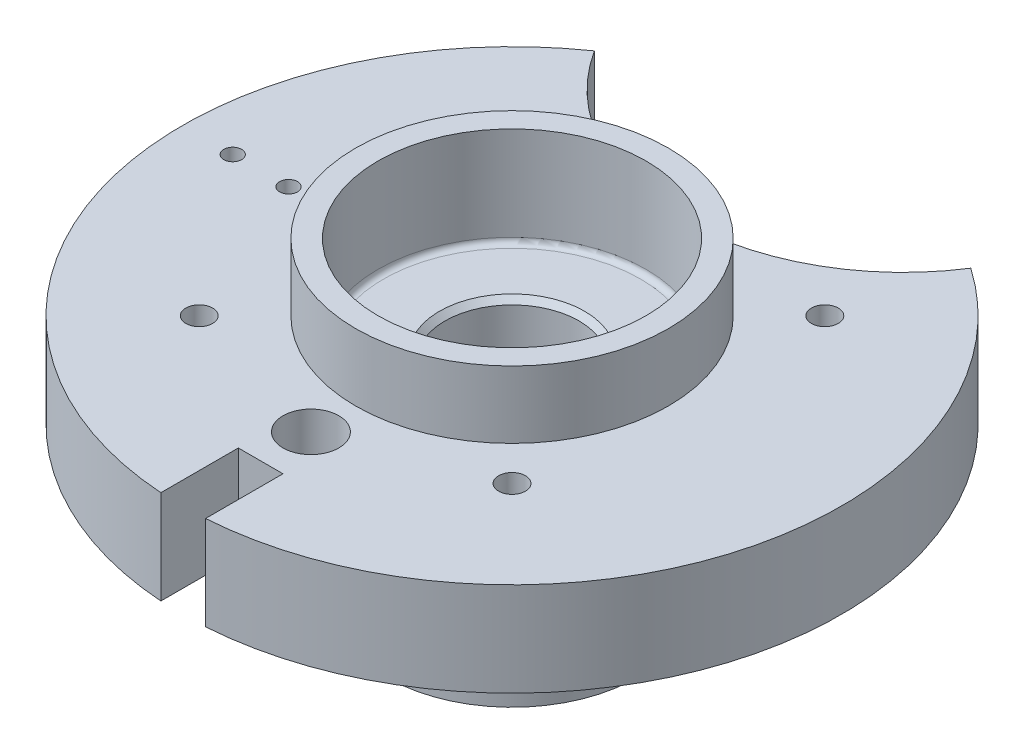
ISO-10303-21;
HEADER;
FILE_DESCRIPTION(('STEP AP214'),'2;1');
FILE_NAME('part.step','',(''),(''),'','','');
FILE_SCHEMA(('AUTOMOTIVE_DESIGN { 1 0 10303 214 1 1 1 1 }'));
ENDSEC;
DATA;
#1=APPLICATION_CONTEXT('core data for automotive mechanical design processes');
#2=APPLICATION_PROTOCOL_DEFINITION('international standard','automotive_design',2000,#1);
#3=PRODUCT_CONTEXT('',#1,'mechanical');
#4=PRODUCT('Part','Part','',(#3));
#5=PRODUCT_RELATED_PRODUCT_CATEGORY('part','',(#4));
#6=PRODUCT_DEFINITION_FORMATION('','',#4);
#7=PRODUCT_DEFINITION_CONTEXT('part definition',#1,'design');
#8=PRODUCT_DEFINITION('design','',#6,#7);
#9=PRODUCT_DEFINITION_SHAPE('','',#8);
#10=(LENGTH_UNIT() NAMED_UNIT(*) SI_UNIT(.MILLI.,.METRE.));
#11=(NAMED_UNIT(*) PLANE_ANGLE_UNIT() SI_UNIT($,.RADIAN.));
#12=(NAMED_UNIT(*) SI_UNIT($,.STERADIAN.) SOLID_ANGLE_UNIT());
#13=UNCERTAINTY_MEASURE_WITH_UNIT(LENGTH_MEASURE(1.E-05),#10,'distance_accuracy_value','');
#14=(GEOMETRIC_REPRESENTATION_CONTEXT(3) GLOBAL_UNCERTAINTY_ASSIGNED_CONTEXT((#13)) GLOBAL_UNIT_ASSIGNED_CONTEXT((#10,
#11,#12)) REPRESENTATION_CONTEXT('',''));
#15=CARTESIAN_POINT('',(0.,0.,0.));
#16=DIRECTION('',(0.,0.,1.));
#17=DIRECTION('',(1.,0.,0.));
#18=AXIS2_PLACEMENT_3D('',#15,#16,#17);
#19=CARTESIAN_POINT('',(0.,0.,0.));
#20=DIRECTION('',(0.,-1.,0.));
#21=DIRECTION('',(0.,0.,-1.));
#22=AXIS2_PLACEMENT_3D('',#19,#20,#21);
#23=CYLINDRICAL_SURFACE('',#22,59.);
#24=CARTESIAN_POINT('',(0.,28.,0.));
#25=DIRECTION('',(0.,-1.,0.));
#26=DIRECTION('',(0.,0.,-1.));
#27=AXIS2_PLACEMENT_3D('',#24,#25,#26);
#28=CIRCLE('',#27,59.);
#29=CARTESIAN_POINT('',(-4.,28.,58.8642506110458));
#30=VERTEX_POINT('',#29);
#31=CARTESIAN_POINT('',(-33.6894877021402,28.,-48.4357142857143));
#32=VERTEX_POINT('',#31);
#33=EDGE_CURVE('E118',#30,#32,#28,.T.);
#34=ORIENTED_EDGE('',*,*,#33,.F.);
#35=DIRECTION('',(0.,1.,0.));
#36=VECTOR('',#35,1.);
#37=CARTESIAN_POINT('',(-4.,-0.001000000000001,58.8642506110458));
#38=LINE('',#37,#36);
#39=CARTESIAN_POINT('',(-4.,44.8,58.8642506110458));
#40=VERTEX_POINT('',#39);
#41=EDGE_CURVE('E100',#30,#40,#38,.T.);
#42=ORIENTED_EDGE('',*,*,#41,.T.);
#43=CARTESIAN_POINT('',(0.,44.8,0.));
#44=DIRECTION('',(0.,-1.,0.));
#45=DIRECTION('',(0.,0.,-1.));
#46=AXIS2_PLACEMENT_3D('',#43,#44,#45);
#47=CIRCLE('',#46,59.);
#48=CARTESIAN_POINT('',(-33.6894877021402,44.8,-48.4357142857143));
#49=VERTEX_POINT('',#48);
#50=EDGE_CURVE('E61',#40,#49,#47,.T.);
#51=ORIENTED_EDGE('',*,*,#50,.T.);
#52=DIRECTION('',(0.,-1.,0.));
#53=VECTOR('',#52,1.);
#54=CARTESIAN_POINT('',(-33.6894877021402,36.4,-48.4357142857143));
#55=LINE('',#54,#53);
#56=EDGE_CURVE('E456',#32,#49,#55,.F.);
#57=ORIENTED_EDGE('',*,*,#56,.F.);
#58=EDGE_LOOP('',(#34,#42,#51,#57));
#59=FACE_BOUND('',#58,.T.);
#60=ADVANCED_FACE('F38',(#59),#23,.T.);
#61=CARTESIAN_POINT('',(0.,0.,0.));
#62=DIRECTION('',(0.,-1.,0.));
#63=DIRECTION('',(0.,0.,-1.));
#64=AXIS2_PLACEMENT_3D('',#61,#62,#63);
#65=CYLINDRICAL_SURFACE('',#64,28.);
#66=CARTESIAN_POINT('',(0.,44.8,0.));
#67=DIRECTION('',(0.,-1.,0.));
#68=DIRECTION('',(0.,0.,-1.));
#69=AXIS2_PLACEMENT_3D('',#66,#67,#68);
#70=CIRCLE('',#69,28.);
#71=CARTESIAN_POINT('',(0.,44.8,-28.));
#72=VERTEX_POINT('',#71);
#73=EDGE_CURVE('E463',#72,#72,#70,.T.);
#74=ORIENTED_EDGE('',*,*,#73,.F.);
#75=EDGE_LOOP('',(#74));
#76=FACE_BOUND('',#75,.T.);
#77=CARTESIAN_POINT('',(0.,56.8,0.));
#78=DIRECTION('',(0.,-1.,0.));
#79=DIRECTION('',(0.,0.,-1.));
#80=AXIS2_PLACEMENT_3D('',#77,#78,#79);
#81=CIRCLE('',#80,28.);
#82=CARTESIAN_POINT('',(0.,56.8,-28.));
#83=VERTEX_POINT('',#82);
#84=EDGE_CURVE('E145',#83,#83,#81,.T.);
#85=ORIENTED_EDGE('',*,*,#84,.T.);
#86=EDGE_LOOP('',(#85));
#87=FACE_BOUND('',#86,.T.);
#88=ADVANCED_FACE('F40',(#76,#87),#65,.T.);
#89=CARTESIAN_POINT('',(24.,56.8,0.));
#90=DIRECTION('',(0.,-1.,0.));
#91=DIRECTION('',(0.,0.,-1.));
#92=AXIS2_PLACEMENT_3D('',#89,#90,#91);
#93=PLANE('',#92);
#94=ORIENTED_EDGE('',*,*,#84,.F.);
#95=EDGE_LOOP('',(#94));
#96=FACE_BOUND('',#95,.T.);
#97=CARTESIAN_POINT('',(0.,56.8,0.));
#98=DIRECTION('',(0.,-1.,0.));
#99=DIRECTION('',(0.,0.,-1.));
#100=AXIS2_PLACEMENT_3D('',#97,#98,#99);
#101=CIRCLE('',#100,24.);
#102=CARTESIAN_POINT('',(0.,56.8,-24.));
#103=VERTEX_POINT('',#102);
#104=EDGE_CURVE('E141',#103,#103,#101,.T.);
#105=ORIENTED_EDGE('',*,*,#104,.T.);
#106=EDGE_LOOP('',(#105));
#107=FACE_BOUND('',#106,.T.);
#108=ADVANCED_FACE('F181',(#96,#107),#93,.F.);
#109=CARTESIAN_POINT('',(0.,0.,0.));
#110=DIRECTION('',(0.,-1.,0.));
#111=DIRECTION('',(0.,0.,-1.));
#112=AXIS2_PLACEMENT_3D('',#109,#110,#111);
#113=CYLINDRICAL_SURFACE('',#112,24.);
#114=CARTESIAN_POINT('',(0.,40.,0.));
#115=DIRECTION('',(0.,-1.,0.));
#116=DIRECTION('',(0.,0.,-1.));
#117=AXIS2_PLACEMENT_3D('',#114,#115,#116);
#118=CIRCLE('',#117,24.);
#119=CARTESIAN_POINT('',(0.,40.,-24.));
#120=VERTEX_POINT('',#119);
#121=EDGE_CURVE('E148',#120,#120,#118,.T.);
#122=ORIENTED_EDGE('',*,*,#121,.T.);
#123=EDGE_LOOP('',(#122));
#124=FACE_BOUND('',#123,.T.);
#125=ORIENTED_EDGE('',*,*,#104,.F.);
#126=EDGE_LOOP('',(#125));
#127=FACE_BOUND('',#126,.T.);
#128=ADVANCED_FACE('F222',(#124,#127),#113,.F.);
#129=CARTESIAN_POINT('',(12.,39.,0.));
#130=DIRECTION('',(0.,-1.,0.));
#131=DIRECTION('',(0.,0.,-1.));
#132=AXIS2_PLACEMENT_3D('',#129,#130,#131);
#133=PLANE('',#132);
#134=CARTESIAN_POINT('',(0.,39.,0.));
#135=DIRECTION('',(0.,-1.,0.));
#136=DIRECTION('',(0.,0.,-1.));
#137=AXIS2_PLACEMENT_3D('',#134,#135,#136);
#138=CIRCLE('',#137,13.);
#139=CARTESIAN_POINT('',(0.,39.,-13.));
#140=VERTEX_POINT('',#139);
#141=EDGE_CURVE('E46',#140,#140,#138,.T.);
#142=ORIENTED_EDGE('',*,*,#141,.T.);
#143=EDGE_LOOP('',(#142));
#144=FACE_BOUND('',#143,.T.);
#145=CARTESIAN_POINT('',(0.,39.,0.));
#146=DIRECTION('',(0.,-1.,0.));
#147=DIRECTION('',(0.,0.,-1.));
#148=AXIS2_PLACEMENT_3D('',#145,#146,#147);
#149=CIRCLE('',#148,23.);
#150=CARTESIAN_POINT('',(0.,39.,-23.));
#151=VERTEX_POINT('',#150);
#152=EDGE_CURVE('E151',#151,#151,#149,.F.);
#153=ORIENTED_EDGE('',*,*,#152,.T.);
#154=EDGE_LOOP('',(#153));
#155=FACE_BOUND('',#154,.T.);
#156=ADVANCED_FACE('F156',(#144,#155),#133,.F.);
#157=CARTESIAN_POINT('',(0.,0.,0.));
#158=DIRECTION('',(0.,-1.,0.));
#159=DIRECTION('',(0.,0.,-1.));
#160=AXIS2_PLACEMENT_3D('',#157,#158,#159);
#161=CYLINDRICAL_SURFACE('',#160,12.);
#162=CARTESIAN_POINT('',(0.,38.,0.));
#163=DIRECTION('',(0.,-1.,0.));
#164=DIRECTION('',(0.,0.,-1.));
#165=AXIS2_PLACEMENT_3D('',#162,#163,#164);
#166=CIRCLE('',#165,12.);
#167=CARTESIAN_POINT('',(0.,38.,-12.));
#168=VERTEX_POINT('',#167);
#169=EDGE_CURVE('E11',#168,#168,#166,.F.);
#170=ORIENTED_EDGE('',*,*,#169,.T.);
#171=EDGE_LOOP('',(#170));
#172=FACE_BOUND('',#171,.T.);
#173=CARTESIAN_POINT('',(0.,0.,0.));
#174=DIRECTION('',(0.,-1.,0.));
#175=DIRECTION('',(0.,0.,-1.));
#176=AXIS2_PLACEMENT_3D('',#173,#174,#175);
#177=CIRCLE('',#176,12.);
#178=CARTESIAN_POINT('',(0.,0.,-12.));
#179=VERTEX_POINT('',#178);
#180=EDGE_CURVE('E137',#179,#179,#177,.T.);
#181=ORIENTED_EDGE('',*,*,#180,.T.);
#182=EDGE_LOOP('',(#181));
#183=FACE_BOUND('',#182,.T.);
#184=ADVANCED_FACE('F215',(#172,#183),#161,.F.);
#185=CARTESIAN_POINT('',(22.5,0.,0.));
#186=DIRECTION('',(0.,1.,0.));
#187=DIRECTION('',(0.,0.,1.));
#188=AXIS2_PLACEMENT_3D('',#185,#186,#187);
#189=PLANE('',#188);
#190=ORIENTED_EDGE('',*,*,#180,.F.);
#191=EDGE_LOOP('',(#190));
#192=FACE_BOUND('',#191,.T.);
#193=CARTESIAN_POINT('',(0.,0.,0.));
#194=DIRECTION('',(0.,-1.,0.));
#195=DIRECTION('',(0.,0.,-1.));
#196=AXIS2_PLACEMENT_3D('',#193,#194,#195);
#197=CIRCLE('',#196,22.5);
#198=CARTESIAN_POINT('',(0.,0.,-22.5));
#199=VERTEX_POINT('',#198);
#200=EDGE_CURVE('E134',#199,#199,#197,.T.);
#201=ORIENTED_EDGE('',*,*,#200,.T.);
#202=EDGE_LOOP('',(#201));
#203=FACE_BOUND('',#202,.T.);
#204=ADVANCED_FACE('F211',(#192,#203),#189,.F.);
#205=CARTESIAN_POINT('',(0.,0.,0.));
#206=DIRECTION('',(0.,-1.,0.));
#207=DIRECTION('',(0.,0.,-1.));
#208=AXIS2_PLACEMENT_3D('',#205,#206,#207);
#209=CYLINDRICAL_SURFACE('',#208,22.5);
#210=ORIENTED_EDGE('',*,*,#200,.F.);
#211=EDGE_LOOP('',(#210));
#212=FACE_BOUND('',#211,.T.);
#213=CARTESIAN_POINT('',(0.,18.,0.));
#214=DIRECTION('',(0.,-1.,0.));
#215=DIRECTION('',(0.,0.,-1.));
#216=AXIS2_PLACEMENT_3D('',#213,#214,#215);
#217=CIRCLE('',#216,22.5);
#218=CARTESIAN_POINT('',(0.,18.,-22.5));
#219=VERTEX_POINT('',#218);
#220=EDGE_CURVE('E130',#219,#219,#217,.T.);
#221=ORIENTED_EDGE('',*,*,#220,.T.);
#222=EDGE_LOOP('',(#221));
#223=FACE_BOUND('',#222,.T.);
#224=ADVANCED_FACE('F207',(#212,#223),#209,.T.);
#225=CARTESIAN_POINT('',(29.,18.,0.));
#226=DIRECTION('',(0.,1.,0.));
#227=DIRECTION('',(0.,0.,1.));
#228=AXIS2_PLACEMENT_3D('',#225,#226,#227);
#229=PLANE('',#228);
#230=ORIENTED_EDGE('',*,*,#220,.F.);
#231=EDGE_LOOP('',(#230));
#232=FACE_BOUND('',#231,.T.);
#233=CARTESIAN_POINT('',(0.,18.,0.));
#234=DIRECTION('',(0.,-1.,0.));
#235=DIRECTION('',(0.,0.,-1.));
#236=AXIS2_PLACEMENT_3D('',#233,#234,#235);
#237=CIRCLE('',#236,29.);
#238=CARTESIAN_POINT('',(0.,18.,-29.));
#239=VERTEX_POINT('',#238);
#240=EDGE_CURVE('E123',#239,#239,#237,.T.);
#241=ORIENTED_EDGE('',*,*,#240,.T.);
#242=EDGE_LOOP('',(#241));
#243=FACE_BOUND('',#242,.T.);
#244=ADVANCED_FACE('F199',(#232,#243),#229,.F.);
#245=CARTESIAN_POINT('',(0.,0.,0.));
#246=DIRECTION('',(0.,-1.,0.));
#247=DIRECTION('',(0.,0.,-1.));
#248=AXIS2_PLACEMENT_3D('',#245,#246,#247);
#249=CYLINDRICAL_SURFACE('',#248,29.);
#250=ORIENTED_EDGE('',*,*,#240,.F.);
#251=EDGE_LOOP('',(#250));
#252=FACE_BOUND('',#251,.T.);
#253=CARTESIAN_POINT('',(0.,28.,0.));
#254=DIRECTION('',(0.,-1.,0.));
#255=DIRECTION('',(0.,0.,-1.));
#256=AXIS2_PLACEMENT_3D('',#253,#254,#255);
#257=CIRCLE('',#256,29.);
#258=CARTESIAN_POINT('',(0.,28.,-29.));
#259=VERTEX_POINT('',#258);
#260=EDGE_CURVE('E117',#259,#259,#257,.T.);
#261=ORIENTED_EDGE('',*,*,#260,.T.);
#262=EDGE_LOOP('',(#261));
#263=FACE_BOUND('',#262,.T.);
#264=ADVANCED_FACE('F194',(#252,#263),#249,.T.);
#265=CARTESIAN_POINT('',(59.,28.,0.));
#266=DIRECTION('',(0.,1.,0.));
#267=DIRECTION('',(0.,0.,1.));
#268=AXIS2_PLACEMENT_3D('',#265,#266,#267);
#269=PLANE('',#268);
#270=CARTESIAN_POINT('',(0.,28.,36.));
#271=DIRECTION('',(0.,1.,0.));
#272=DIRECTION('',(0.,0.,1.));
#273=AXIS2_PLACEMENT_3D('',#270,#271,#272);
#274=CIRCLE('',#273,5.);
#275=CARTESIAN_POINT('',(0.,28.,41.));
#276=VERTEX_POINT('',#275);
#277=EDGE_CURVE('E418',#276,#276,#274,.T.);
#278=ORIENTED_EDGE('',*,*,#277,.T.);
#279=EDGE_LOOP('',(#278));
#280=FACE_BOUND('',#279,.T.);
#281=CARTESIAN_POINT('',(-50.,28.,0.));
#282=DIRECTION('',(0.,1.,0.));
#283=DIRECTION('',(0.,0.,1.));
#284=AXIS2_PLACEMENT_3D('',#281,#282,#283);
#285=CIRCLE('',#284,1.6);
#286=CARTESIAN_POINT('',(-50.,28.,1.6));
#287=VERTEX_POINT('',#286);
#288=EDGE_CURVE('E423',#287,#287,#285,.F.);
#289=ORIENTED_EDGE('',*,*,#288,.F.);
#290=EDGE_LOOP('',(#289));
#291=FACE_BOUND('',#290,.T.);
#292=CARTESIAN_POINT('',(-40.,28.,0.));
#293=DIRECTION('',(0.,1.,0.));
#294=DIRECTION('',(0.,0.,1.));
#295=AXIS2_PLACEMENT_3D('',#292,#293,#294);
#296=CIRCLE('',#295,1.6);
#297=CARTESIAN_POINT('',(-40.,28.,1.6));
#298=VERTEX_POINT('',#297);
#299=EDGE_CURVE('E429',#298,#298,#296,.F.);
#300=ORIENTED_EDGE('',*,*,#299,.F.);
#301=EDGE_LOOP('',(#300));
#302=FACE_BOUND('',#301,.T.);
#303=CARTESIAN_POINT('',(26.,28.,26.));
#304=DIRECTION('',(0.,1.,0.));
#305=DIRECTION('',(0.,0.,1.));
#306=AXIS2_PLACEMENT_3D('',#303,#304,#305);
#307=CIRCLE('',#306,2.4);
#308=CARTESIAN_POINT('',(26.,28.,28.4));
#309=VERTEX_POINT('',#308);
#310=EDGE_CURVE('E435',#309,#309,#307,.F.);
#311=ORIENTED_EDGE('',*,*,#310,.F.);
#312=EDGE_LOOP('',(#311));
#313=FACE_BOUND('',#312,.T.);
#314=CARTESIAN_POINT('',(-28.,28.,28.));
#315=DIRECTION('',(0.,1.,0.));
#316=DIRECTION('',(0.,0.,1.));
#317=AXIS2_PLACEMENT_3D('',#314,#315,#316);
#318=CIRCLE('',#317,2.4);
#319=CARTESIAN_POINT('',(-28.,28.,30.4));
#320=VERTEX_POINT('',#319);
#321=EDGE_CURVE('E441',#320,#320,#318,.F.);
#322=ORIENTED_EDGE('',*,*,#321,.F.);
#323=EDGE_LOOP('',(#322));
#324=FACE_BOUND('',#323,.T.);
#325=CARTESIAN_POINT('',(28.,28.,-28.));
#326=DIRECTION('',(0.,1.,0.));
#327=DIRECTION('',(0.,0.,1.));
#328=AXIS2_PLACEMENT_3D('',#325,#326,#327);
#329=CIRCLE('',#328,2.4);
#330=CARTESIAN_POINT('',(28.,28.,-25.6));
#331=VERTEX_POINT('',#330);
#332=EDGE_CURVE('E447',#331,#331,#329,.F.);
#333=ORIENTED_EDGE('',*,*,#332,.F.);
#334=EDGE_LOOP('',(#333));
#335=FACE_BOUND('',#334,.T.);
#336=CARTESIAN_POINT('',(-26.,28.,-26.));
#337=DIRECTION('',(0.,1.,0.));
#338=DIRECTION('',(0.,0.,1.));
#339=AXIS2_PLACEMENT_3D('',#336,#337,#338);
#340=CIRCLE('',#339,2.4);
#341=CARTESIAN_POINT('',(-26.,28.,-23.6));
#342=VERTEX_POINT('',#341);
#343=EDGE_CURVE('E453',#342,#342,#340,.F.);
#344=ORIENTED_EDGE('',*,*,#343,.F.);
#345=EDGE_LOOP('',(#344));
#346=FACE_BOUND('',#345,.T.);
#347=ORIENTED_EDGE('',*,*,#260,.F.);
#348=EDGE_LOOP('',(#347));
#349=FACE_BOUND('',#348,.T.);
#350=DIRECTION('',(1.,0.,0.));
#351=VECTOR('',#350,1.);
#352=CARTESIAN_POINT('',(4.,28.,45.));
#353=LINE('',#352,#351);
#354=CARTESIAN_POINT('',(-4.,28.,45.));
#355=VERTEX_POINT('',#354);
#356=CARTESIAN_POINT('',(4.,28.,45.));
#357=VERTEX_POINT('',#356);
#358=EDGE_CURVE('E399',#355,#357,#353,.T.);
#359=ORIENTED_EDGE('',*,*,#358,.F.);
#360=DIRECTION('',(0.,0.,-1.));
#361=VECTOR('',#360,1.);
#362=CARTESIAN_POINT('',(-4.,28.,58.8642506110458));
#363=LINE('',#362,#361);
#364=EDGE_CURVE('E404',#30,#355,#363,.T.);
#365=ORIENTED_EDGE('',*,*,#364,.F.);
#366=ORIENTED_EDGE('',*,*,#33,.T.);
#367=CARTESIAN_POINT('',(0.,28.,-70.));
#368=DIRECTION('',(0.,1.,0.));
#369=DIRECTION('',(0.,0.,1.));
#370=AXIS2_PLACEMENT_3D('',#367,#368,#369);
#371=CIRCLE('',#370,40.);
#372=CARTESIAN_POINT('',(33.6894877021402,28.,-48.4357142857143));
#373=VERTEX_POINT('',#372);
#374=EDGE_CURVE('E115',#373,#32,#371,.F.);
#375=ORIENTED_EDGE('',*,*,#374,.F.);
#376=CARTESIAN_POINT('',(4.,28.,58.8642506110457));
#377=VERTEX_POINT('',#376);
#378=EDGE_CURVE('E107',#373,#377,#28,.T.);
#379=ORIENTED_EDGE('',*,*,#378,.T.);
#380=DIRECTION('',(0.,0.,1.));
#381=VECTOR('',#380,1.);
#382=CARTESIAN_POINT('',(4.,28.,58.8642506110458));
#383=LINE('',#382,#381);
#384=EDGE_CURVE('E92',#357,#377,#383,.T.);
#385=ORIENTED_EDGE('',*,*,#384,.F.);
#386=EDGE_LOOP('',(#359,#365,#366,#375,#379,#385));
#387=FACE_BOUND('',#386,.T.);
#388=ADVANCED_FACE('F113',(#280,#291,#302,#313,#324,#335,#346,#349,#387),#269,.F.);
#389=CARTESIAN_POINT('',(33.6894877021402,44.8,-48.4357142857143));
#390=VERTEX_POINT('',#389);
#391=CARTESIAN_POINT('',(4.,44.8,58.8642506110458));
#392=VERTEX_POINT('',#391);
#393=EDGE_CURVE('E109',#390,#392,#47,.T.);
#394=ORIENTED_EDGE('',*,*,#393,.T.);
#395=DIRECTION('',(0.,1.,0.));
#396=VECTOR('',#395,1.);
#397=CARTESIAN_POINT('',(4.,-0.001000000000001,58.8642506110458));
#398=LINE('',#397,#396);
#399=EDGE_CURVE('E53',#377,#392,#398,.T.);
#400=ORIENTED_EDGE('',*,*,#399,.F.);
#401=ORIENTED_EDGE('',*,*,#378,.F.);
#402=DIRECTION('',(0.,-1.,0.));
#403=VECTOR('',#402,1.);
#404=CARTESIAN_POINT('',(33.6894877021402,36.4,-48.4357142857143));
#405=LINE('',#404,#403);
#406=EDGE_CURVE('E458',#390,#373,#405,.T.);
#407=ORIENTED_EDGE('',*,*,#406,.F.);
#408=EDGE_LOOP('',(#394,#400,#401,#407));
#409=FACE_BOUND('',#408,.T.);
#410=ADVANCED_FACE('F105',(#409),#23,.T.);
#411=CARTESIAN_POINT('',(28.,44.8,0.));
#412=DIRECTION('',(0.,-1.,0.));
#413=DIRECTION('',(0.,0.,-1.));
#414=AXIS2_PLACEMENT_3D('',#411,#412,#413);
#415=PLANE('',#414);
#416=CARTESIAN_POINT('',(0.,44.8,36.));
#417=DIRECTION('',(0.,1.,0.));
#418=DIRECTION('',(0.,0.,1.));
#419=AXIS2_PLACEMENT_3D('',#416,#417,#418);
#420=CIRCLE('',#419,5.);
#421=CARTESIAN_POINT('',(0.,44.8,41.));
#422=VERTEX_POINT('',#421);
#423=EDGE_CURVE('E99',#422,#422,#420,.T.);
#424=ORIENTED_EDGE('',*,*,#423,.F.);
#425=EDGE_LOOP('',(#424));
#426=FACE_BOUND('',#425,.T.);
#427=CARTESIAN_POINT('',(-50.,44.8,0.));
#428=DIRECTION('',(0.,1.,0.));
#429=DIRECTION('',(0.,0.,1.));
#430=AXIS2_PLACEMENT_3D('',#427,#428,#429);
#431=CIRCLE('',#430,1.6);
#432=CARTESIAN_POINT('',(-50.,44.8,1.6));
#433=VERTEX_POINT('',#432);
#434=EDGE_CURVE('E420',#433,#433,#431,.T.);
#435=ORIENTED_EDGE('',*,*,#434,.F.);
#436=EDGE_LOOP('',(#435));
#437=FACE_BOUND('',#436,.T.);
#438=CARTESIAN_POINT('',(-40.,44.8,0.));
#439=DIRECTION('',(0.,1.,0.));
#440=DIRECTION('',(0.,0.,1.));
#441=AXIS2_PLACEMENT_3D('',#438,#439,#440);
#442=CIRCLE('',#441,1.6);
#443=CARTESIAN_POINT('',(-40.,44.8,1.6));
#444=VERTEX_POINT('',#443);
#445=EDGE_CURVE('E426',#444,#444,#442,.T.);
#446=ORIENTED_EDGE('',*,*,#445,.F.);
#447=EDGE_LOOP('',(#446));
#448=FACE_BOUND('',#447,.T.);
#449=CARTESIAN_POINT('',(26.,44.8,26.));
#450=DIRECTION('',(0.,1.,0.));
#451=DIRECTION('',(0.,0.,1.));
#452=AXIS2_PLACEMENT_3D('',#449,#450,#451);
#453=CIRCLE('',#452,2.4);
#454=CARTESIAN_POINT('',(26.,44.8,28.4));
#455=VERTEX_POINT('',#454);
#456=EDGE_CURVE('E432',#455,#455,#453,.T.);
#457=ORIENTED_EDGE('',*,*,#456,.F.);
#458=EDGE_LOOP('',(#457));
#459=FACE_BOUND('',#458,.T.);
#460=CARTESIAN_POINT('',(-28.,44.8,28.));
#461=DIRECTION('',(0.,1.,0.));
#462=DIRECTION('',(0.,0.,1.));
#463=AXIS2_PLACEMENT_3D('',#460,#461,#462);
#464=CIRCLE('',#463,2.4);
#465=CARTESIAN_POINT('',(-28.,44.8,30.4));
#466=VERTEX_POINT('',#465);
#467=EDGE_CURVE('E438',#466,#466,#464,.T.);
#468=ORIENTED_EDGE('',*,*,#467,.F.);
#469=EDGE_LOOP('',(#468));
#470=FACE_BOUND('',#469,.T.);
#471=CARTESIAN_POINT('',(28.,44.8,-28.));
#472=DIRECTION('',(0.,1.,0.));
#473=DIRECTION('',(0.,0.,1.));
#474=AXIS2_PLACEMENT_3D('',#471,#472,#473);
#475=CIRCLE('',#474,2.4);
#476=CARTESIAN_POINT('',(28.,44.8,-25.6));
#477=VERTEX_POINT('',#476);
#478=EDGE_CURVE('E444',#477,#477,#475,.T.);
#479=ORIENTED_EDGE('',*,*,#478,.F.);
#480=EDGE_LOOP('',(#479));
#481=FACE_BOUND('',#480,.T.);
#482=CARTESIAN_POINT('',(-26.,44.8,-26.));
#483=DIRECTION('',(0.,1.,0.));
#484=DIRECTION('',(0.,0.,1.));
#485=AXIS2_PLACEMENT_3D('',#482,#483,#484);
#486=CIRCLE('',#485,2.4);
#487=CARTESIAN_POINT('',(-26.,44.8,-23.6));
#488=VERTEX_POINT('',#487);
#489=EDGE_CURVE('E450',#488,#488,#486,.T.);
#490=ORIENTED_EDGE('',*,*,#489,.F.);
#491=EDGE_LOOP('',(#490));
#492=FACE_BOUND('',#491,.T.);
#493=ORIENTED_EDGE('',*,*,#50,.F.);
#494=DIRECTION('',(0.,0.,1.));
#495=VECTOR('',#494,1.);
#496=CARTESIAN_POINT('',(-4.,44.8,58.8642506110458));
#497=LINE('',#496,#495);
#498=CARTESIAN_POINT('',(-4.,44.8,45.));
#499=VERTEX_POINT('',#498);
#500=EDGE_CURVE('E110',#499,#40,#497,.T.);
#501=ORIENTED_EDGE('',*,*,#500,.F.);
#502=DIRECTION('',(-1.,0.,0.));
#503=VECTOR('',#502,1.);
#504=CARTESIAN_POINT('',(4.,44.8,45.));
#505=LINE('',#504,#503);
#506=CARTESIAN_POINT('',(4.,44.8,45.));
#507=VERTEX_POINT('',#506);
#508=EDGE_CURVE('E410',#507,#499,#505,.T.);
#509=ORIENTED_EDGE('',*,*,#508,.F.);
#510=DIRECTION('',(0.,0.,-1.));
#511=VECTOR('',#510,1.);
#512=CARTESIAN_POINT('',(4.,44.8,58.8642506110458));
#513=LINE('',#512,#511);
#514=EDGE_CURVE('E406',#392,#507,#513,.T.);
#515=ORIENTED_EDGE('',*,*,#514,.F.);
#516=ORIENTED_EDGE('',*,*,#393,.F.);
#517=CARTESIAN_POINT('',(0.,44.8,-70.));
#518=DIRECTION('',(0.,1.,0.));
#519=DIRECTION('',(0.,0.,1.));
#520=AXIS2_PLACEMENT_3D('',#517,#518,#519);
#521=CIRCLE('',#520,40.);
#522=EDGE_CURVE('E460',#49,#390,#521,.T.);
#523=ORIENTED_EDGE('',*,*,#522,.F.);
#524=EDGE_LOOP('',(#493,#501,#509,#515,#516,#523));
#525=FACE_BOUND('',#524,.T.);
#526=ORIENTED_EDGE('',*,*,#73,.T.);
#527=EDGE_LOOP('',(#526));
#528=FACE_BOUND('',#527,.T.);
#529=ADVANCED_FACE('F187',(#426,#437,#448,#459,#470,#481,#492,#525,#528),#415,.F.);
#530=CARTESIAN_POINT('',(0.,-0.001000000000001,-70.));
#531=DIRECTION('',(0.,1.,0.));
#532=DIRECTION('',(0.,0.,1.));
#533=AXIS2_PLACEMENT_3D('',#530,#531,#532);
#534=CYLINDRICAL_SURFACE('',#533,40.);
#535=ORIENTED_EDGE('',*,*,#406,.T.);
#536=ORIENTED_EDGE('',*,*,#374,.T.);
#537=ORIENTED_EDGE('',*,*,#56,.T.);
#538=ORIENTED_EDGE('',*,*,#522,.T.);
#539=EDGE_LOOP('',(#535,#536,#537,#538));
#540=FACE_BOUND('',#539,.T.);
#541=ADVANCED_FACE('F192',(#540),#534,.F.);
#542=CARTESIAN_POINT('',(-26.,-0.001000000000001,-26.));
#543=DIRECTION('',(0.,1.,0.));
#544=DIRECTION('',(0.,0.,1.));
#545=AXIS2_PLACEMENT_3D('',#542,#543,#544);
#546=CYLINDRICAL_SURFACE('',#545,2.4);
#547=ORIENTED_EDGE('',*,*,#489,.T.);
#548=EDGE_LOOP('',(#547));
#549=FACE_BOUND('',#548,.T.);
#550=ORIENTED_EDGE('',*,*,#343,.T.);
#551=EDGE_LOOP('',(#550));
#552=FACE_BOUND('',#551,.T.);
#553=ADVANCED_FACE('F281',(#549,#552),#546,.F.);
#554=CARTESIAN_POINT('',(28.,-0.001000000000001,-28.));
#555=DIRECTION('',(0.,1.,0.));
#556=DIRECTION('',(0.,0.,1.));
#557=AXIS2_PLACEMENT_3D('',#554,#555,#556);
#558=CYLINDRICAL_SURFACE('',#557,2.4);
#559=ORIENTED_EDGE('',*,*,#478,.T.);
#560=EDGE_LOOP('',(#559));
#561=FACE_BOUND('',#560,.T.);
#562=ORIENTED_EDGE('',*,*,#332,.T.);
#563=EDGE_LOOP('',(#562));
#564=FACE_BOUND('',#563,.T.);
#565=ADVANCED_FACE('F276',(#561,#564),#558,.F.);
#566=CARTESIAN_POINT('',(-28.,-0.001000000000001,28.));
#567=DIRECTION('',(0.,1.,0.));
#568=DIRECTION('',(0.,0.,1.));
#569=AXIS2_PLACEMENT_3D('',#566,#567,#568);
#570=CYLINDRICAL_SURFACE('',#569,2.4);
#571=ORIENTED_EDGE('',*,*,#467,.T.);
#572=EDGE_LOOP('',(#571));
#573=FACE_BOUND('',#572,.T.);
#574=ORIENTED_EDGE('',*,*,#321,.T.);
#575=EDGE_LOOP('',(#574));
#576=FACE_BOUND('',#575,.T.);
#577=ADVANCED_FACE('F280',(#573,#576),#570,.F.);
#578=CARTESIAN_POINT('',(26.,-0.001000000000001,26.));
#579=DIRECTION('',(0.,1.,0.));
#580=DIRECTION('',(0.,0.,1.));
#581=AXIS2_PLACEMENT_3D('',#578,#579,#580);
#582=CYLINDRICAL_SURFACE('',#581,2.4);
#583=ORIENTED_EDGE('',*,*,#456,.T.);
#584=EDGE_LOOP('',(#583));
#585=FACE_BOUND('',#584,.T.);
#586=ORIENTED_EDGE('',*,*,#310,.T.);
#587=EDGE_LOOP('',(#586));
#588=FACE_BOUND('',#587,.T.);
#589=ADVANCED_FACE('F295',(#585,#588),#582,.F.);
#590=CARTESIAN_POINT('',(-40.,-0.001000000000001,0.));
#591=DIRECTION('',(0.,1.,0.));
#592=DIRECTION('',(0.,0.,1.));
#593=AXIS2_PLACEMENT_3D('',#590,#591,#592);
#594=CYLINDRICAL_SURFACE('',#593,1.6);
#595=ORIENTED_EDGE('',*,*,#445,.T.);
#596=EDGE_LOOP('',(#595));
#597=FACE_BOUND('',#596,.T.);
#598=ORIENTED_EDGE('',*,*,#299,.T.);
#599=EDGE_LOOP('',(#598));
#600=FACE_BOUND('',#599,.T.);
#601=ADVANCED_FACE('F303',(#597,#600),#594,.F.);
#602=CARTESIAN_POINT('',(-50.,-0.001000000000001,0.));
#603=DIRECTION('',(0.,1.,0.));
#604=DIRECTION('',(0.,0.,1.));
#605=AXIS2_PLACEMENT_3D('',#602,#603,#604);
#606=CYLINDRICAL_SURFACE('',#605,1.6);
#607=ORIENTED_EDGE('',*,*,#434,.T.);
#608=EDGE_LOOP('',(#607));
#609=FACE_BOUND('',#608,.T.);
#610=ORIENTED_EDGE('',*,*,#288,.T.);
#611=EDGE_LOOP('',(#610));
#612=FACE_BOUND('',#611,.T.);
#613=ADVANCED_FACE('F172',(#609,#612),#606,.F.);
#614=CARTESIAN_POINT('',(0.,40.,0.));
#615=DIRECTION('',(0.,-1.,0.));
#616=DIRECTION('',(0.,0.,-1.));
#617=AXIS2_PLACEMENT_3D('',#614,#615,#616);
#618=TOROIDAL_SURFACE('',#617,23.,1.);
#619=ORIENTED_EDGE('',*,*,#152,.F.);
#620=EDGE_LOOP('',(#619));
#621=FACE_BOUND('',#620,.T.);
#622=ORIENTED_EDGE('',*,*,#121,.F.);
#623=EDGE_LOOP('',(#622));
#624=FACE_BOUND('',#623,.T.);
#625=ADVANCED_FACE('F162',(#621,#624),#618,.F.);
#626=CARTESIAN_POINT('',(0.,39.,0.));
#627=DIRECTION('',(0.,1.,0.));
#628=DIRECTION('',(0.,0.,1.));
#629=AXIS2_PLACEMENT_3D('',#626,#627,#628);
#630=CONICAL_SURFACE('',#629,13.,0.785398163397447);
#631=ORIENTED_EDGE('',*,*,#169,.F.);
#632=EDGE_LOOP('',(#631));
#633=FACE_BOUND('',#632,.T.);
#634=ORIENTED_EDGE('',*,*,#141,.F.);
#635=EDGE_LOOP('',(#634));
#636=FACE_BOUND('',#635,.T.);
#637=ADVANCED_FACE('F159',(#633,#636),#630,.F.);
#638=CARTESIAN_POINT('',(0.,0.,36.));
#639=DIRECTION('',(0.,1.,0.));
#640=DIRECTION('',(0.,0.,1.));
#641=AXIS2_PLACEMENT_3D('',#638,#639,#640);
#642=CYLINDRICAL_SURFACE('',#641,5.);
#643=ORIENTED_EDGE('',*,*,#423,.T.);
#644=EDGE_LOOP('',(#643));
#645=FACE_BOUND('',#644,.T.);
#646=ORIENTED_EDGE('',*,*,#277,.F.);
#647=EDGE_LOOP('',(#646));
#648=FACE_BOUND('',#647,.T.);
#649=ADVANCED_FACE('F161',(#645,#648),#642,.F.);
#650=CARTESIAN_POINT('',(-4.,-0.001000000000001,58.8642506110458));
#651=DIRECTION('',(-1.,0.,0.));
#652=DIRECTION('',(0.,0.,1.));
#653=AXIS2_PLACEMENT_3D('',#650,#651,#652);
#654=PLANE('',#653);
#655=ORIENTED_EDGE('',*,*,#364,.T.);
#656=DIRECTION('',(0.,1.,0.));
#657=VECTOR('',#656,1.);
#658=CARTESIAN_POINT('',(-4.,-0.001000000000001,45.));
#659=LINE('',#658,#657);
#660=EDGE_CURVE('E401',#355,#499,#659,.T.);
#661=ORIENTED_EDGE('',*,*,#660,.T.);
#662=ORIENTED_EDGE('',*,*,#500,.T.);
#663=ORIENTED_EDGE('',*,*,#41,.F.);
#664=EDGE_LOOP('',(#655,#661,#662,#663));
#665=FACE_BOUND('',#664,.T.);
#666=ADVANCED_FACE('F169',(#665),#654,.F.);
#667=CARTESIAN_POINT('',(4.,-0.001000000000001,45.));
#668=DIRECTION('',(0.,0.,-1.));
#669=DIRECTION('',(-1.,0.,0.));
#670=AXIS2_PLACEMENT_3D('',#667,#668,#669);
#671=PLANE('',#670);
#672=ORIENTED_EDGE('',*,*,#358,.T.);
#673=DIRECTION('',(0.,1.,0.));
#674=VECTOR('',#673,1.);
#675=CARTESIAN_POINT('',(4.,-0.001000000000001,45.));
#676=LINE('',#675,#674);
#677=EDGE_CURVE('E94',#357,#507,#676,.T.);
#678=ORIENTED_EDGE('',*,*,#677,.T.);
#679=ORIENTED_EDGE('',*,*,#508,.T.);
#680=ORIENTED_EDGE('',*,*,#660,.F.);
#681=EDGE_LOOP('',(#672,#678,#679,#680));
#682=FACE_BOUND('',#681,.T.);
#683=ADVANCED_FACE('F377',(#682),#671,.F.);
#684=CARTESIAN_POINT('',(4.,-0.001000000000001,58.8642506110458));
#685=DIRECTION('',(1.,0.,0.));
#686=DIRECTION('',(0.,0.,-1.));
#687=AXIS2_PLACEMENT_3D('',#684,#685,#686);
#688=PLANE('',#687);
#689=ORIENTED_EDGE('',*,*,#384,.T.);
#690=ORIENTED_EDGE('',*,*,#399,.T.);
#691=ORIENTED_EDGE('',*,*,#514,.T.);
#692=ORIENTED_EDGE('',*,*,#677,.F.);
#693=EDGE_LOOP('',(#689,#690,#691,#692));
#694=FACE_BOUND('',#693,.T.);
#695=ADVANCED_FACE('F93',(#694),#688,.F.);
#696=CLOSED_SHELL('',(#60,#88,#108,#128,#156,#184,#204,#224,#244,#264,#388,#410,#529,#541,#553,
#565,#577,#589,#601,#613,#625,#637,#649,#666,#683,#695));
#697=MANIFOLD_SOLID_BREP('B2',#696);
#698=ADVANCED_BREP_SHAPE_REPRESENTATION('',(#18,#697),#14);
#699=SHAPE_DEFINITION_REPRESENTATION(#9,#698);
ENDSEC;
END-ISO-10303-21;
